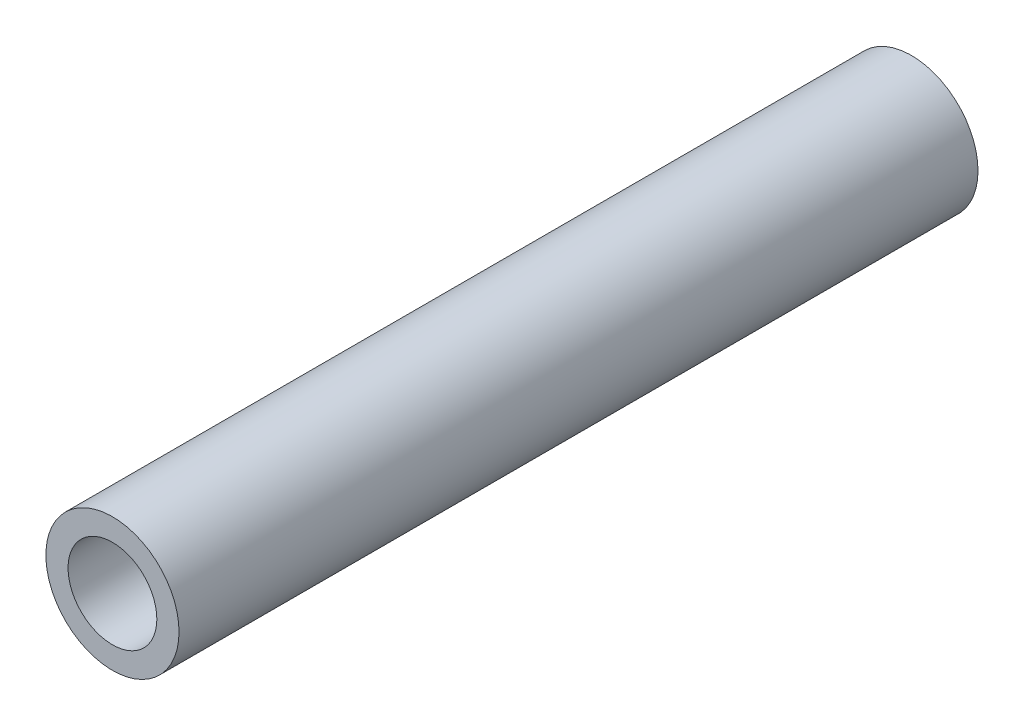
ISO-10303-21;
HEADER;
FILE_DESCRIPTION(('STEP AP214'),'2;1');
FILE_NAME('part.step','',(''),(''),'','','');
FILE_SCHEMA(('AUTOMOTIVE_DESIGN { 1 0 10303 214 1 1 1 1 }'));
ENDSEC;
DATA;
#1=APPLICATION_CONTEXT('core data for automotive mechanical design processes');
#2=APPLICATION_PROTOCOL_DEFINITION('international standard','automotive_design',2000,#1);
#3=PRODUCT_CONTEXT('',#1,'mechanical');
#4=PRODUCT('Part','Part','',(#3));
#5=PRODUCT_RELATED_PRODUCT_CATEGORY('part','',(#4));
#6=PRODUCT_DEFINITION_FORMATION('','',#4);
#7=PRODUCT_DEFINITION_CONTEXT('part definition',#1,'design');
#8=PRODUCT_DEFINITION('design','',#6,#7);
#9=PRODUCT_DEFINITION_SHAPE('','',#8);
#10=(LENGTH_UNIT() NAMED_UNIT(*) SI_UNIT(.MILLI.,.METRE.));
#11=(NAMED_UNIT(*) PLANE_ANGLE_UNIT() SI_UNIT($,.RADIAN.));
#12=(NAMED_UNIT(*) SI_UNIT($,.STERADIAN.) SOLID_ANGLE_UNIT());
#13=UNCERTAINTY_MEASURE_WITH_UNIT(LENGTH_MEASURE(1.E-05),#10,'distance_accuracy_value','');
#14=(GEOMETRIC_REPRESENTATION_CONTEXT(3) GLOBAL_UNCERTAINTY_ASSIGNED_CONTEXT((#13)) GLOBAL_UNIT_ASSIGNED_CONTEXT((#10,
#11,#12)) REPRESENTATION_CONTEXT('',''));
#15=CARTESIAN_POINT('',(0.,0.,0.));
#16=DIRECTION('',(0.,0.,1.));
#17=DIRECTION('',(1.,0.,0.));
#18=AXIS2_PLACEMENT_3D('',#15,#16,#17);
#19=CARTESIAN_POINT('',(0.,0.,36.));
#20=DIRECTION('',(0.,0.,1.));
#21=DIRECTION('',(1.,0.,0.));
#22=AXIS2_PLACEMENT_3D('',#19,#20,#21);
#23=PLANE('',#22);
#24=CARTESIAN_POINT('',(0.,0.,36.));
#25=DIRECTION('',(0.,0.,1.));
#26=DIRECTION('',(1.,0.,0.));
#27=AXIS2_PLACEMENT_3D('',#24,#25,#26);
#28=CIRCLE('',#27,3.);
#29=CARTESIAN_POINT('',(3.,0.,36.));
#30=VERTEX_POINT('',#29);
#31=EDGE_CURVE('E10',#30,#30,#28,.T.);
#32=ORIENTED_EDGE('',*,*,#31,.T.);
#33=EDGE_LOOP('',(#32));
#34=FACE_BOUND('',#33,.T.);
#35=CARTESIAN_POINT('',(0.,0.,36.));
#36=DIRECTION('',(0.,0.,1.));
#37=DIRECTION('',(1.,0.,0.));
#38=AXIS2_PLACEMENT_3D('',#35,#36,#37);
#39=CIRCLE('',#38,2.);
#40=CARTESIAN_POINT('',(2.,0.,36.));
#41=VERTEX_POINT('',#40);
#42=EDGE_CURVE('E42',#41,#41,#39,.T.);
#43=ORIENTED_EDGE('',*,*,#42,.F.);
#44=EDGE_LOOP('',(#43));
#45=FACE_BOUND('',#44,.T.);
#46=ADVANCED_FACE('F31',(#34,#45),#23,.T.);
#47=CARTESIAN_POINT('',(0.,0.,0.));
#48=DIRECTION('',(0.,0.,1.));
#49=DIRECTION('',(1.,0.,0.));
#50=AXIS2_PLACEMENT_3D('',#47,#48,#49);
#51=PLANE('',#50);
#52=CARTESIAN_POINT('',(0.,0.,0.));
#53=DIRECTION('',(0.,0.,1.));
#54=DIRECTION('',(1.,0.,0.));
#55=AXIS2_PLACEMENT_3D('',#52,#53,#54);
#56=CIRCLE('',#55,3.);
#57=CARTESIAN_POINT('',(3.,0.,0.));
#58=VERTEX_POINT('',#57);
#59=EDGE_CURVE('E35',#58,#58,#56,.T.);
#60=ORIENTED_EDGE('',*,*,#59,.F.);
#61=EDGE_LOOP('',(#60));
#62=FACE_BOUND('',#61,.T.);
#63=CARTESIAN_POINT('',(0.,0.,0.));
#64=DIRECTION('',(0.,0.,1.));
#65=DIRECTION('',(1.,0.,0.));
#66=AXIS2_PLACEMENT_3D('',#63,#64,#65);
#67=CIRCLE('',#66,2.);
#68=CARTESIAN_POINT('',(2.,0.,0.));
#69=VERTEX_POINT('',#68);
#70=EDGE_CURVE('E44',#69,#69,#67,.T.);
#71=ORIENTED_EDGE('',*,*,#70,.T.);
#72=EDGE_LOOP('',(#71));
#73=FACE_BOUND('',#72,.T.);
#74=ADVANCED_FACE('F54',(#62,#73),#51,.F.);
#75=CARTESIAN_POINT('',(0.,0.,36.));
#76=DIRECTION('',(0.,0.,-1.));
#77=DIRECTION('',(-1.,0.,0.));
#78=AXIS2_PLACEMENT_3D('',#75,#76,#77);
#79=CYLINDRICAL_SURFACE('',#78,3.);
#80=ORIENTED_EDGE('',*,*,#31,.F.);
#81=EDGE_LOOP('',(#80));
#82=FACE_BOUND('',#81,.T.);
#83=ORIENTED_EDGE('',*,*,#59,.T.);
#84=EDGE_LOOP('',(#83));
#85=FACE_BOUND('',#84,.T.);
#86=ADVANCED_FACE('F33',(#82,#85),#79,.T.);
#87=CARTESIAN_POINT('',(0.,0.,36.));
#88=DIRECTION('',(0.,0.,-1.));
#89=DIRECTION('',(-1.,0.,0.));
#90=AXIS2_PLACEMENT_3D('',#87,#88,#89);
#91=CYLINDRICAL_SURFACE('',#90,2.);
#92=ORIENTED_EDGE('',*,*,#42,.T.);
#93=EDGE_LOOP('',(#92));
#94=FACE_BOUND('',#93,.T.);
#95=ORIENTED_EDGE('',*,*,#70,.F.);
#96=EDGE_LOOP('',(#95));
#97=FACE_BOUND('',#96,.T.);
#98=ADVANCED_FACE('F50',(#94,#97),#91,.F.);
#99=CLOSED_SHELL('',(#46,#74,#86,#98));
#100=MANIFOLD_SOLID_BREP('B2',#99);
#101=ADVANCED_BREP_SHAPE_REPRESENTATION('',(#18,#100),#14);
#102=SHAPE_DEFINITION_REPRESENTATION(#9,#101);
ENDSEC;
END-ISO-10303-21;
